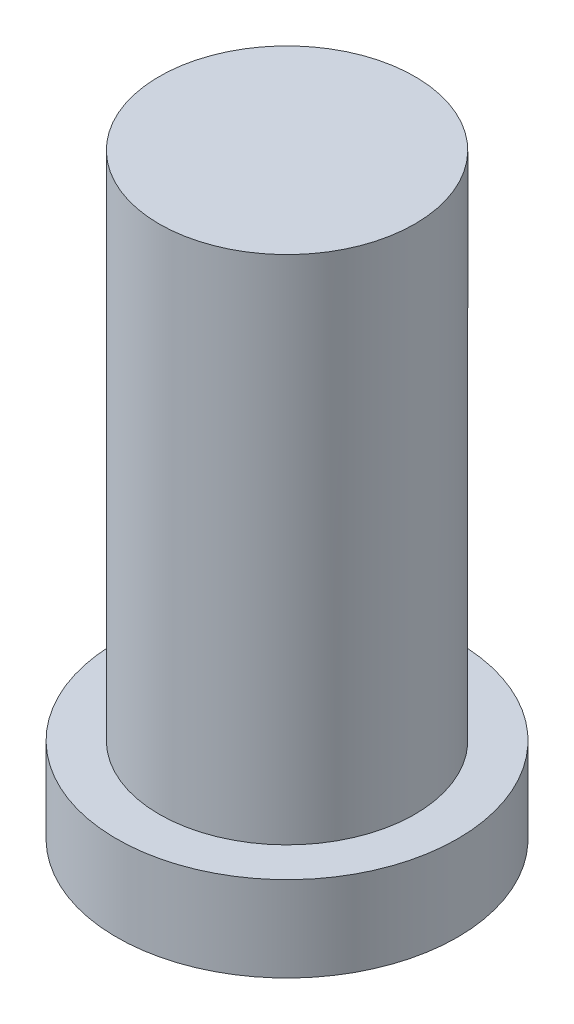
ISO-10303-21;
HEADER;
FILE_DESCRIPTION(('STEP AP214'),'2;1');
FILE_NAME('part.step','',(''),(''),'','','');
FILE_SCHEMA(('AUTOMOTIVE_DESIGN { 1 0 10303 214 1 1 1 1 }'));
ENDSEC;
DATA;
#1=APPLICATION_CONTEXT('core data for automotive mechanical design processes');
#2=APPLICATION_PROTOCOL_DEFINITION('international standard','automotive_design',2000,#1);
#3=PRODUCT_CONTEXT('',#1,'mechanical');
#4=PRODUCT('Part','Part','',(#3));
#5=PRODUCT_RELATED_PRODUCT_CATEGORY('part','',(#4));
#6=PRODUCT_DEFINITION_FORMATION('','',#4);
#7=PRODUCT_DEFINITION_CONTEXT('part definition',#1,'design');
#8=PRODUCT_DEFINITION('design','',#6,#7);
#9=PRODUCT_DEFINITION_SHAPE('','',#8);
#10=(LENGTH_UNIT() NAMED_UNIT(*) SI_UNIT(.MILLI.,.METRE.));
#11=(NAMED_UNIT(*) PLANE_ANGLE_UNIT() SI_UNIT($,.RADIAN.));
#12=(NAMED_UNIT(*) SI_UNIT($,.STERADIAN.) SOLID_ANGLE_UNIT());
#13=UNCERTAINTY_MEASURE_WITH_UNIT(LENGTH_MEASURE(1.E-05),#10,'distance_accuracy_value','');
#14=(GEOMETRIC_REPRESENTATION_CONTEXT(3) GLOBAL_UNCERTAINTY_ASSIGNED_CONTEXT((#13)) GLOBAL_UNIT_ASSIGNED_CONTEXT((#10,
#11,#12)) REPRESENTATION_CONTEXT('',''));
#15=CARTESIAN_POINT('',(0.,0.,0.));
#16=DIRECTION('',(0.,0.,1.));
#17=DIRECTION('',(1.,0.,0.));
#18=AXIS2_PLACEMENT_3D('',#15,#16,#17);
#19=CARTESIAN_POINT('',(0.,-6.,0.));
#20=DIRECTION('',(0.,1.,0.));
#21=DIRECTION('',(0.,0.,1.));
#22=AXIS2_PLACEMENT_3D('',#19,#20,#21);
#23=CYLINDRICAL_SURFACE('',#22,1.5);
#24=CARTESIAN_POINT('',(0.,-6.,0.));
#25=DIRECTION('',(0.,1.,0.));
#26=DIRECTION('',(0.,0.,1.));
#27=AXIS2_PLACEMENT_3D('',#24,#25,#26);
#28=CIRCLE('',#27,1.5);
#29=CARTESIAN_POINT('',(0.,-6.,1.5));
#30=VERTEX_POINT('',#29);
#31=EDGE_CURVE('E21',#30,#30,#28,.F.);
#32=ORIENTED_EDGE('',*,*,#31,.F.);
#33=EDGE_LOOP('',(#32));
#34=FACE_BOUND('',#33,.T.);
#35=CARTESIAN_POINT('',(0.,0.,0.));
#36=DIRECTION('',(0.,1.,0.));
#37=DIRECTION('',(1.,0.,0.));
#38=AXIS2_PLACEMENT_3D('',#35,#36,#37);
#39=CIRCLE('',#38,1.5);
#40=CARTESIAN_POINT('',(1.5,0.,0.));
#41=VERTEX_POINT('',#40);
#42=EDGE_CURVE('E9',#41,#41,#39,.T.);
#43=ORIENTED_EDGE('',*,*,#42,.F.);
#44=EDGE_LOOP('',(#43));
#45=FACE_BOUND('',#44,.T.);
#46=ADVANCED_FACE('F14',(#34,#45),#23,.T.);
#47=CARTESIAN_POINT('',(0.,0.,0.));
#48=DIRECTION('',(0.,1.,0.));
#49=DIRECTION('',(0.,0.,1.));
#50=AXIS2_PLACEMENT_3D('',#47,#48,#49);
#51=PLANE('',#50);
#52=ORIENTED_EDGE('',*,*,#42,.T.);
#53=EDGE_LOOP('',(#52));
#54=FACE_BOUND('',#53,.T.);
#55=ADVANCED_FACE('F44',(#54),#51,.T.);
#56=CARTESIAN_POINT('',(0.,-7.,0.));
#57=DIRECTION('',(0.,1.,0.));
#58=DIRECTION('',(0.,0.,1.));
#59=AXIS2_PLACEMENT_3D('',#56,#57,#58);
#60=CYLINDRICAL_SURFACE('',#59,2.);
#61=CARTESIAN_POINT('',(0.,-7.,0.));
#62=DIRECTION('',(0.,1.,0.));
#63=DIRECTION('',(1.,0.,0.));
#64=AXIS2_PLACEMENT_3D('',#61,#62,#63);
#65=CIRCLE('',#64,2.);
#66=CARTESIAN_POINT('',(2.,-7.,0.));
#67=VERTEX_POINT('',#66);
#68=EDGE_CURVE('E28',#67,#67,#65,.T.);
#69=ORIENTED_EDGE('',*,*,#68,.T.);
#70=EDGE_LOOP('',(#69));
#71=FACE_BOUND('',#70,.T.);
#72=CARTESIAN_POINT('',(0.,-6.,0.));
#73=DIRECTION('',(0.,1.,0.));
#74=DIRECTION('',(1.,0.,0.));
#75=AXIS2_PLACEMENT_3D('',#72,#73,#74);
#76=CIRCLE('',#75,2.);
#77=CARTESIAN_POINT('',(2.,-6.,0.));
#78=VERTEX_POINT('',#77);
#79=EDGE_CURVE('E32',#78,#78,#76,.T.);
#80=ORIENTED_EDGE('',*,*,#79,.F.);
#81=EDGE_LOOP('',(#80));
#82=FACE_BOUND('',#81,.T.);
#83=ADVANCED_FACE('F41',(#71,#82),#60,.T.);
#84=CARTESIAN_POINT('',(0.,-7.,0.));
#85=DIRECTION('',(0.,1.,0.));
#86=DIRECTION('',(0.,0.,1.));
#87=AXIS2_PLACEMENT_3D('',#84,#85,#86);
#88=PLANE('',#87);
#89=ORIENTED_EDGE('',*,*,#68,.F.);
#90=EDGE_LOOP('',(#89));
#91=FACE_BOUND('',#90,.T.);
#92=ADVANCED_FACE('F43',(#91),#88,.F.);
#93=CARTESIAN_POINT('',(0.,-6.,0.));
#94=DIRECTION('',(0.,1.,0.));
#95=DIRECTION('',(0.,0.,1.));
#96=AXIS2_PLACEMENT_3D('',#93,#94,#95);
#97=PLANE('',#96);
#98=ORIENTED_EDGE('',*,*,#31,.T.);
#99=EDGE_LOOP('',(#98));
#100=FACE_BOUND('',#99,.T.);
#101=ORIENTED_EDGE('',*,*,#79,.T.);
#102=EDGE_LOOP('',(#101));
#103=FACE_BOUND('',#102,.T.);
#104=ADVANCED_FACE('F39',(#100,#103),#97,.T.);
#105=CLOSED_SHELL('',(#46,#55,#83,#92,#104));
#106=MANIFOLD_SOLID_BREP('B1',#105);
#107=ADVANCED_BREP_SHAPE_REPRESENTATION('',(#18,#106),#14);
#108=SHAPE_DEFINITION_REPRESENTATION(#9,#107);
ENDSEC;
END-ISO-10303-21;
